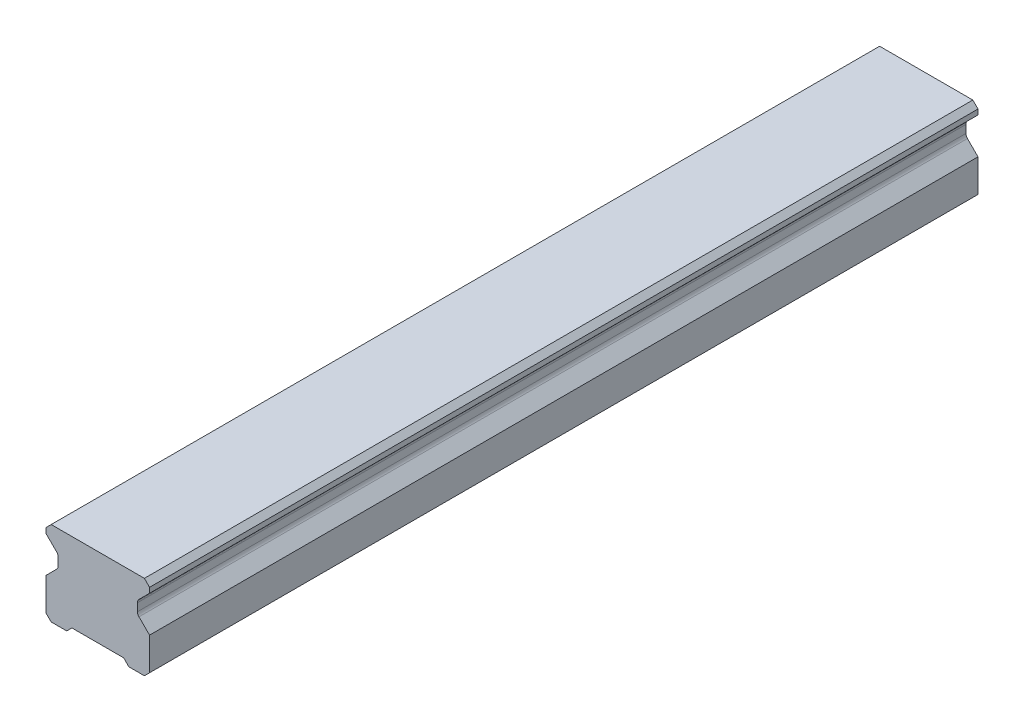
ISO-10303-21;
HEADER;
FILE_DESCRIPTION(('STEP AP214'),'2;1');
FILE_NAME('part.step','',(''),(''),'','','');
FILE_SCHEMA(('AUTOMOTIVE_DESIGN { 1 0 10303 214 1 1 1 1 }'));
ENDSEC;
DATA;
#1=APPLICATION_CONTEXT('core data for automotive mechanical design processes');
#2=APPLICATION_PROTOCOL_DEFINITION('international standard','automotive_design',2000,#1);
#3=PRODUCT_CONTEXT('',#1,'mechanical');
#4=PRODUCT('Part','Part','',(#3));
#5=PRODUCT_RELATED_PRODUCT_CATEGORY('part','',(#4));
#6=PRODUCT_DEFINITION_FORMATION('','',#4);
#7=PRODUCT_DEFINITION_CONTEXT('part definition',#1,'design');
#8=PRODUCT_DEFINITION('design','',#6,#7);
#9=PRODUCT_DEFINITION_SHAPE('','',#8);
#10=(LENGTH_UNIT() NAMED_UNIT(*) SI_UNIT(.MILLI.,.METRE.));
#11=(NAMED_UNIT(*) PLANE_ANGLE_UNIT() SI_UNIT($,.RADIAN.));
#12=(NAMED_UNIT(*) SI_UNIT($,.STERADIAN.) SOLID_ANGLE_UNIT());
#13=UNCERTAINTY_MEASURE_WITH_UNIT(LENGTH_MEASURE(1.E-05),#10,'distance_accuracy_value','');
#14=(GEOMETRIC_REPRESENTATION_CONTEXT(3) GLOBAL_UNCERTAINTY_ASSIGNED_CONTEXT((#13)) GLOBAL_UNIT_ASSIGNED_CONTEXT((#10,
#11,#12)) REPRESENTATION_CONTEXT('',''));
#15=CARTESIAN_POINT('',(0.,0.,0.));
#16=DIRECTION('',(0.,0.,1.));
#17=DIRECTION('',(1.,0.,0.));
#18=AXIS2_PLACEMENT_3D('',#15,#16,#17);
#19=CARTESIAN_POINT('',(0.,11.,-60.));
#20=DIRECTION('',(0.,-1.,0.));
#21=DIRECTION('',(0.,0.,-1.));
#22=AXIS2_PLACEMENT_3D('',#19,#20,#21);
#23=PLANE('',#22);
#24=CARTESIAN_POINT('',(0.,11.,-60.));
#25=DIRECTION('',(0.,-1.,0.));
#26=DIRECTION('',(0.,0.,-1.));
#27=AXIS2_PLACEMENT_3D('',#24,#25,#26);
#28=CIRCLE('',#27,2.5);
#29=CARTESIAN_POINT('',(0.,11.,-62.5));
#30=VERTEX_POINT('',#29);
#31=EDGE_CURVE('E42',#30,#30,#28,.T.);
#32=ORIENTED_EDGE('',*,*,#31,.F.);
#33=EDGE_LOOP('',(#32));
#34=FACE_BOUND('',#33,.T.);
#35=CARTESIAN_POINT('',(0.,11.,-60.));
#36=DIRECTION('',(0.,-1.,0.));
#37=DIRECTION('',(0.,0.,-1.));
#38=AXIS2_PLACEMENT_3D('',#35,#36,#37);
#39=CIRCLE('',#38,3.);
#40=CARTESIAN_POINT('',(0.,11.,-63.));
#41=VERTEX_POINT('',#40);
#42=EDGE_CURVE('E11',#41,#41,#39,.T.);
#43=ORIENTED_EDGE('',*,*,#42,.T.);
#44=EDGE_LOOP('',(#43));
#45=FACE_BOUND('',#44,.T.);
#46=ADVANCED_FACE('F39',(#34,#45),#23,.T.);
#47=CARTESIAN_POINT('',(0.,11.,-60.));
#48=DIRECTION('',(0.,-1.,0.));
#49=DIRECTION('',(0.,0.,-1.));
#50=AXIS2_PLACEMENT_3D('',#47,#48,#49);
#51=CYLINDRICAL_SURFACE('',#50,3.);
#52=ORIENTED_EDGE('',*,*,#42,.F.);
#53=EDGE_LOOP('',(#52));
#54=FACE_BOUND('',#53,.T.);
#55=CARTESIAN_POINT('',(0.,1.00000000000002,-60.));
#56=DIRECTION('',(0.,-1.,0.));
#57=DIRECTION('',(0.,0.,-1.));
#58=AXIS2_PLACEMENT_3D('',#55,#56,#57);
#59=CIRCLE('',#58,3.);
#60=CARTESIAN_POINT('',(0.,1.00000000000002,-63.));
#61=VERTEX_POINT('',#60);
#62=EDGE_CURVE('E48',#61,#61,#59,.T.);
#63=ORIENTED_EDGE('',*,*,#62,.T.);
#64=EDGE_LOOP('',(#63));
#65=FACE_BOUND('',#64,.T.);
#66=ADVANCED_FACE('F491',(#54,#65),#51,.F.);
#67=CARTESIAN_POINT('',(10.,0.,80.));
#68=DIRECTION('',(0.,1.,0.));
#69=DIRECTION('',(-1.,0.,0.));
#70=AXIS2_PLACEMENT_3D('',#67,#68,#69);
#71=PLANE('',#70);
#72=DIRECTION('',(1.,0.,0.));
#73=VECTOR('',#72,1.);
#74=CARTESIAN_POINT('',(10.,0.,-80.));
#75=LINE('',#74,#73);
#76=CARTESIAN_POINT('',(-9.,0.,-80.));
#77=VERTEX_POINT('',#76);
#78=CARTESIAN_POINT('',(-6.00000000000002,0.,-80.));
#79=VERTEX_POINT('',#78);
#80=EDGE_CURVE('E370',#77,#79,#75,.T.);
#81=ORIENTED_EDGE('',*,*,#80,.T.);
#82=DIRECTION('',(0.,0.,1.));
#83=VECTOR('',#82,1.);
#84=CARTESIAN_POINT('',(-6.00000000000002,0.,-80.));
#85=LINE('',#84,#83);
#86=CARTESIAN_POINT('',(-6.00000000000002,0.,80.));
#87=VERTEX_POINT('',#86);
#88=EDGE_CURVE('E276',#79,#87,#85,.T.);
#89=ORIENTED_EDGE('',*,*,#88,.T.);
#90=DIRECTION('',(1.,0.,0.));
#91=VECTOR('',#90,1.);
#92=CARTESIAN_POINT('',(10.,0.,80.));
#93=LINE('',#92,#91);
#94=CARTESIAN_POINT('',(-9.,0.,80.));
#95=VERTEX_POINT('',#94);
#96=EDGE_CURVE('E351',#95,#87,#93,.T.);
#97=ORIENTED_EDGE('',*,*,#96,.F.);
#98=DIRECTION('',(0.,0.,-1.));
#99=VECTOR('',#98,1.);
#100=CARTESIAN_POINT('',(-9.,0.,80.));
#101=LINE('',#100,#99);
#102=EDGE_CURVE('E422',#95,#77,#101,.T.);
#103=ORIENTED_EDGE('',*,*,#102,.T.);
#104=EDGE_LOOP('',(#81,#89,#97,#103));
#105=FACE_BOUND('',#104,.T.);
#106=ADVANCED_FACE('F516',(#105),#71,.F.);
#107=CARTESIAN_POINT('',(-10.,16.3,80.));
#108=DIRECTION('',(1.,0.,0.));
#109=DIRECTION('',(0.,1.,0.));
#110=AXIS2_PLACEMENT_3D('',#107,#108,#109);
#111=PLANE('',#110);
#112=DIRECTION('',(0.,-1.,0.));
#113=VECTOR('',#112,1.);
#114=CARTESIAN_POINT('',(-10.,16.3,80.));
#115=LINE('',#114,#113);
#116=CARTESIAN_POINT('',(-10.,15.3,80.));
#117=VERTEX_POINT('',#116);
#118=CARTESIAN_POINT('',(-10.,14.3,80.));
#119=VERTEX_POINT('',#118);
#120=EDGE_CURVE('E345',#117,#119,#115,.T.);
#121=ORIENTED_EDGE('',*,*,#120,.F.);
#122=DIRECTION('',(0.,0.,-1.));
#123=VECTOR('',#122,1.);
#124=CARTESIAN_POINT('',(-10.,15.3,80.));
#125=LINE('',#124,#123);
#126=CARTESIAN_POINT('',(-10.,15.3,-80.));
#127=VERTEX_POINT('',#126);
#128=EDGE_CURVE('E364',#117,#127,#125,.T.);
#129=ORIENTED_EDGE('',*,*,#128,.T.);
#130=DIRECTION('',(0.,-1.,0.));
#131=VECTOR('',#130,1.);
#132=CARTESIAN_POINT('',(-10.,16.3,-80.));
#133=LINE('',#132,#131);
#134=CARTESIAN_POINT('',(-10.,14.3,-80.));
#135=VERTEX_POINT('',#134);
#136=EDGE_CURVE('E365',#127,#135,#133,.T.);
#137=ORIENTED_EDGE('',*,*,#136,.T.);
#138=DIRECTION('',(0.,0.,1.));
#139=VECTOR('',#138,1.);
#140=CARTESIAN_POINT('',(-10.,14.3,-80.));
#141=LINE('',#140,#139);
#142=EDGE_CURVE('E299',#135,#119,#141,.T.);
#143=ORIENTED_EDGE('',*,*,#142,.T.);
#144=EDGE_LOOP('',(#121,#129,#137,#143));
#145=FACE_BOUND('',#144,.T.);
#146=ADVANCED_FACE('F555',(#145),#111,.F.);
#147=CARTESIAN_POINT('',(10.,16.3,80.));
#148=DIRECTION('',(-1.,0.,0.));
#149=DIRECTION('',(0.,-1.,0.));
#150=AXIS2_PLACEMENT_3D('',#147,#148,#149);
#151=PLANE('',#150);
#152=DIRECTION('',(0.,1.,0.));
#153=VECTOR('',#152,1.);
#154=CARTESIAN_POINT('',(10.,16.3,80.));
#155=LINE('',#154,#153);
#156=CARTESIAN_POINT('',(10.,1.00000000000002,80.));
#157=VERTEX_POINT('',#156);
#158=CARTESIAN_POINT('',(10.,7.3,80.));
#159=VERTEX_POINT('',#158);
#160=EDGE_CURVE('E356',#157,#159,#155,.T.);
#161=ORIENTED_EDGE('',*,*,#160,.F.);
#162=DIRECTION('',(0.,0.,-1.));
#163=VECTOR('',#162,1.);
#164=CARTESIAN_POINT('',(10.,1.00000000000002,80.));
#165=LINE('',#164,#163);
#166=CARTESIAN_POINT('',(10.,1.00000000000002,-80.));
#167=VERTEX_POINT('',#166);
#168=EDGE_CURVE('E429',#157,#167,#165,.T.);
#169=ORIENTED_EDGE('',*,*,#168,.T.);
#170=DIRECTION('',(0.,1.,0.));
#171=VECTOR('',#170,1.);
#172=CARTESIAN_POINT('',(10.,16.3,-80.));
#173=LINE('',#172,#171);
#174=CARTESIAN_POINT('',(10.,7.3,-80.));
#175=VERTEX_POINT('',#174);
#176=EDGE_CURVE('E375',#167,#175,#173,.T.);
#177=ORIENTED_EDGE('',*,*,#176,.T.);
#178=DIRECTION('',(0.,0.,1.));
#179=VECTOR('',#178,1.);
#180=CARTESIAN_POINT('',(10.,7.3,-80.));
#181=LINE('',#180,#179);
#182=EDGE_CURVE('E330',#175,#159,#181,.T.);
#183=ORIENTED_EDGE('',*,*,#182,.T.);
#184=EDGE_LOOP('',(#161,#169,#177,#183));
#185=FACE_BOUND('',#184,.T.);
#186=ADVANCED_FACE('F602',(#185),#151,.F.);
#187=CARTESIAN_POINT('',(-10.,7.3,-80.));
#188=VERTEX_POINT('',#187);
#189=CARTESIAN_POINT('',(-10.,1.00000000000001,-80.));
#190=VERTEX_POINT('',#189);
#191=EDGE_CURVE('E314',#188,#190,#133,.T.);
#192=ORIENTED_EDGE('',*,*,#191,.T.);
#193=DIRECTION('',(0.,0.,1.));
#194=VECTOR('',#193,1.);
#195=CARTESIAN_POINT('',(-10.,1.00000000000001,80.));
#196=LINE('',#195,#194);
#197=CARTESIAN_POINT('',(-10.,1.00000000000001,80.));
#198=VERTEX_POINT('',#197);
#199=EDGE_CURVE('E426',#190,#198,#196,.T.);
#200=ORIENTED_EDGE('',*,*,#199,.T.);
#201=CARTESIAN_POINT('',(-10.,7.3,80.));
#202=VERTEX_POINT('',#201);
#203=EDGE_CURVE('E350',#202,#198,#115,.T.);
#204=ORIENTED_EDGE('',*,*,#203,.F.);
#205=DIRECTION('',(0.,0.,1.));
#206=VECTOR('',#205,1.);
#207=CARTESIAN_POINT('',(-10.,7.3,-80.));
#208=LINE('',#207,#206);
#209=EDGE_CURVE('E311',#188,#202,#208,.T.);
#210=ORIENTED_EDGE('',*,*,#209,.F.);
#211=EDGE_LOOP('',(#192,#200,#204,#210));
#212=FACE_BOUND('',#211,.T.);
#213=ADVANCED_FACE('F598',(#212),#111,.F.);
#214=CARTESIAN_POINT('',(6.00000000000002,0.,80.));
#215=VERTEX_POINT('',#214);
#216=CARTESIAN_POINT('',(8.99999999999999,0.,80.));
#217=VERTEX_POINT('',#216);
#218=EDGE_CURVE('E349',#215,#217,#93,.T.);
#219=ORIENTED_EDGE('',*,*,#218,.F.);
#220=DIRECTION('',(0.,0.,1.));
#221=VECTOR('',#220,1.);
#222=CARTESIAN_POINT('',(6.00000000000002,0.,-80.));
#223=LINE('',#222,#221);
#224=CARTESIAN_POINT('',(6.00000000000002,0.,-80.));
#225=VERTEX_POINT('',#224);
#226=EDGE_CURVE('E266',#225,#215,#223,.T.);
#227=ORIENTED_EDGE('',*,*,#226,.F.);
#228=CARTESIAN_POINT('',(8.99999999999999,0.,-80.));
#229=VERTEX_POINT('',#228);
#230=EDGE_CURVE('E369',#225,#229,#75,.T.);
#231=ORIENTED_EDGE('',*,*,#230,.T.);
#232=DIRECTION('',(0.,0.,1.));
#233=VECTOR('',#232,1.);
#234=CARTESIAN_POINT('',(8.99999999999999,0.,80.));
#235=LINE('',#234,#233);
#236=EDGE_CURVE('E418',#229,#217,#235,.T.);
#237=ORIENTED_EDGE('',*,*,#236,.T.);
#238=EDGE_LOOP('',(#219,#227,#231,#237));
#239=FACE_BOUND('',#238,.T.);
#240=ADVANCED_FACE('F601',(#239),#71,.F.);
#241=CARTESIAN_POINT('',(10.,14.3,-80.));
#242=VERTEX_POINT('',#241);
#243=CARTESIAN_POINT('',(10.,15.3,-80.));
#244=VERTEX_POINT('',#243);
#245=EDGE_CURVE('E374',#242,#244,#173,.T.);
#246=ORIENTED_EDGE('',*,*,#245,.T.);
#247=DIRECTION('',(0.,0.,1.));
#248=VECTOR('',#247,1.);
#249=CARTESIAN_POINT('',(10.,15.3,80.));
#250=LINE('',#249,#248);
#251=CARTESIAN_POINT('',(10.,15.3,80.));
#252=VERTEX_POINT('',#251);
#253=EDGE_CURVE('E433',#244,#252,#250,.T.);
#254=ORIENTED_EDGE('',*,*,#253,.T.);
#255=CARTESIAN_POINT('',(10.,14.3,80.));
#256=VERTEX_POINT('',#255);
#257=EDGE_CURVE('E355',#256,#252,#155,.T.);
#258=ORIENTED_EDGE('',*,*,#257,.F.);
#259=DIRECTION('',(0.,0.,1.));
#260=VECTOR('',#259,1.);
#261=CARTESIAN_POINT('',(10.,14.3,-80.));
#262=LINE('',#261,#260);
#263=EDGE_CURVE('E304',#242,#256,#262,.T.);
#264=ORIENTED_EDGE('',*,*,#263,.F.);
#265=EDGE_LOOP('',(#246,#254,#258,#264));
#266=FACE_BOUND('',#265,.T.);
#267=ADVANCED_FACE('F533',(#266),#151,.F.);
#268=CARTESIAN_POINT('',(10.,16.3,80.));
#269=DIRECTION('',(0.,-1.,0.));
#270=DIRECTION('',(0.,0.,-1.));
#271=AXIS2_PLACEMENT_3D('',#268,#269,#270);
#272=PLANE('',#271);
#273=DIRECTION('',(-1.,0.,0.));
#274=VECTOR('',#273,1.);
#275=CARTESIAN_POINT('',(10.,16.3,-80.));
#276=LINE('',#275,#274);
#277=CARTESIAN_POINT('',(9.00000000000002,16.3,-80.));
#278=VERTEX_POINT('',#277);
#279=CARTESIAN_POINT('',(-9.,16.3,-80.));
#280=VERTEX_POINT('',#279);
#281=EDGE_CURVE('E379',#278,#280,#276,.T.);
#282=ORIENTED_EDGE('',*,*,#281,.T.);
#283=DIRECTION('',(0.,0.,1.));
#284=VECTOR('',#283,1.);
#285=CARTESIAN_POINT('',(-9.,16.3,80.));
#286=LINE('',#285,#284);
#287=CARTESIAN_POINT('',(-9.,16.3,80.));
#288=VERTEX_POINT('',#287);
#289=EDGE_CURVE('E403',#280,#288,#286,.T.);
#290=ORIENTED_EDGE('',*,*,#289,.T.);
#291=DIRECTION('',(-1.,0.,0.));
#292=VECTOR('',#291,1.);
#293=CARTESIAN_POINT('',(10.,16.3,80.));
#294=LINE('',#293,#292);
#295=CARTESIAN_POINT('',(9.00000000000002,16.3,80.));
#296=VERTEX_POINT('',#295);
#297=EDGE_CURVE('E360',#296,#288,#294,.T.);
#298=ORIENTED_EDGE('',*,*,#297,.F.);
#299=DIRECTION('',(0.,0.,-1.));
#300=VECTOR('',#299,1.);
#301=CARTESIAN_POINT('',(9.00000000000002,16.3,80.));
#302=LINE('',#301,#300);
#303=EDGE_CURVE('E399',#296,#278,#302,.T.);
#304=ORIENTED_EDGE('',*,*,#303,.T.);
#305=EDGE_LOOP('',(#282,#290,#298,#304));
#306=FACE_BOUND('',#305,.T.);
#307=ADVANCED_FACE('F546',(#306),#272,.F.);
#308=CARTESIAN_POINT('',(0.,0.,80.));
#309=DIRECTION('',(0.,0.,-1.));
#310=DIRECTION('',(-1.,0.,0.));
#311=AXIS2_PLACEMENT_3D('',#308,#309,#310);
#312=PLANE('',#311);
#313=ORIENTED_EDGE('',*,*,#96,.T.);
#314=DIRECTION('',(-0.707106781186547,-0.707106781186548,0.));
#315=VECTOR('',#314,1.);
#316=CARTESIAN_POINT('',(-6.00000000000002,0.,80.));
#317=LINE('',#316,#315);
#318=CARTESIAN_POINT('',(-5.,1.00000000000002,80.));
#319=VERTEX_POINT('',#318);
#320=EDGE_CURVE('E259',#319,#87,#317,.T.);
#321=ORIENTED_EDGE('',*,*,#320,.F.);
#322=DIRECTION('',(-1.,0.,0.));
#323=VECTOR('',#322,1.);
#324=CARTESIAN_POINT('',(-5.,1.00000000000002,80.));
#325=LINE('',#324,#323);
#326=CARTESIAN_POINT('',(5.,1.00000000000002,80.));
#327=VERTEX_POINT('',#326);
#328=EDGE_CURVE('E270',#327,#319,#325,.T.);
#329=ORIENTED_EDGE('',*,*,#328,.F.);
#330=DIRECTION('',(-0.707106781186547,0.707106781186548,0.));
#331=VECTOR('',#330,1.);
#332=CARTESIAN_POINT('',(5.,1.00000000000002,80.));
#333=LINE('',#332,#331);
#334=EDGE_CURVE('E251',#215,#327,#333,.T.);
#335=ORIENTED_EDGE('',*,*,#334,.F.);
#336=ORIENTED_EDGE('',*,*,#218,.T.);
#337=DIRECTION('',(-0.707106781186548,-0.707106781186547,0.));
#338=VECTOR('',#337,1.);
#339=CARTESIAN_POINT('',(10.,1.00000000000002,80.));
#340=LINE('',#339,#338);
#341=EDGE_CURVE('E409',#217,#157,#340,.F.);
#342=ORIENTED_EDGE('',*,*,#341,.T.);
#343=ORIENTED_EDGE('',*,*,#160,.T.);
#344=DIRECTION('',(0.707106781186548,-0.707106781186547,0.));
#345=VECTOR('',#344,1.);
#346=CARTESIAN_POINT('',(10.,7.3,80.));
#347=LINE('',#346,#345);
#348=CARTESIAN_POINT('',(7.95955988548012,9.34044011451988,80.));
#349=VERTEX_POINT('',#348);
#350=EDGE_CURVE('E280',#349,#159,#347,.T.);
#351=ORIENTED_EDGE('',*,*,#350,.F.);
#352=CARTESIAN_POINT('',(8.66666666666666,10.0475468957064,80.));
#353=DIRECTION('',(0.,0.,-1.));
#354=DIRECTION('',(-1.,0.,0.));
#355=AXIS2_PLACEMENT_3D('',#352,#353,#354);
#356=CIRCLE('',#355,1.);
#357=CARTESIAN_POINT('',(7.66666666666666,10.0475468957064,80.));
#358=VERTEX_POINT('',#357);
#359=EDGE_CURVE('E464',#349,#358,#356,.T.);
#360=ORIENTED_EDGE('',*,*,#359,.T.);
#361=DIRECTION('',(0.,-1.,0.));
#362=VECTOR('',#361,1.);
#363=CARTESIAN_POINT('',(7.66666666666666,9.63333333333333,80.));
#364=LINE('',#363,#362);
#365=CARTESIAN_POINT('',(7.66666666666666,11.5524531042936,80.));
#366=VERTEX_POINT('',#365);
#367=EDGE_CURVE('E322',#366,#358,#364,.T.);
#368=ORIENTED_EDGE('',*,*,#367,.F.);
#369=CARTESIAN_POINT('',(8.66666666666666,11.5524531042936,80.));
#370=DIRECTION('',(0.,0.,-1.));
#371=DIRECTION('',(-1.,0.,0.));
#372=AXIS2_PLACEMENT_3D('',#369,#370,#371);
#373=CIRCLE('',#372,1.);
#374=CARTESIAN_POINT('',(7.95955988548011,12.2595598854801,80.));
#375=VERTEX_POINT('',#374);
#376=EDGE_CURVE('E470',#366,#375,#373,.T.);
#377=ORIENTED_EDGE('',*,*,#376,.T.);
#378=DIRECTION('',(-0.707106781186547,-0.707106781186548,0.));
#379=VECTOR('',#378,1.);
#380=CARTESIAN_POINT('',(7.66666666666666,11.9666666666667,80.));
#381=LINE('',#380,#379);
#382=EDGE_CURVE('E333',#256,#375,#381,.T.);
#383=ORIENTED_EDGE('',*,*,#382,.F.);
#384=ORIENTED_EDGE('',*,*,#257,.T.);
#385=DIRECTION('',(0.707106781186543,-0.707106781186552,0.));
#386=VECTOR('',#385,1.);
#387=CARTESIAN_POINT('',(9.00000000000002,16.3,80.));
#388=LINE('',#387,#386);
#389=EDGE_CURVE('E406',#252,#296,#388,.F.);
#390=ORIENTED_EDGE('',*,*,#389,.T.);
#391=ORIENTED_EDGE('',*,*,#297,.T.);
#392=DIRECTION('',(0.707106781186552,0.707106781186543,0.));
#393=VECTOR('',#392,1.);
#394=CARTESIAN_POINT('',(-10.,15.3,80.));
#395=LINE('',#394,#393);
#396=EDGE_CURVE('E415',#288,#117,#395,.F.);
#397=ORIENTED_EDGE('',*,*,#396,.T.);
#398=ORIENTED_EDGE('',*,*,#120,.T.);
#399=DIRECTION('',(-0.707106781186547,0.707106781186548,0.));
#400=VECTOR('',#399,1.);
#401=CARTESIAN_POINT('',(-7.66666666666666,11.9666666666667,80.));
#402=LINE('',#401,#400);
#403=CARTESIAN_POINT('',(-7.95955988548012,12.2595598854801,80.));
#404=VERTEX_POINT('',#403);
#405=EDGE_CURVE('E300',#404,#119,#402,.T.);
#406=ORIENTED_EDGE('',*,*,#405,.F.);
#407=CARTESIAN_POINT('',(-8.66666666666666,11.5524531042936,80.));
#408=DIRECTION('',(0.,0.,-1.));
#409=DIRECTION('',(-1.,0.,0.));
#410=AXIS2_PLACEMENT_3D('',#407,#408,#409);
#411=CIRCLE('',#410,1.);
#412=CARTESIAN_POINT('',(-7.66666666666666,11.5524531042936,80.));
#413=VERTEX_POINT('',#412);
#414=EDGE_CURVE('E482',#404,#413,#411,.T.);
#415=ORIENTED_EDGE('',*,*,#414,.T.);
#416=DIRECTION('',(0.,1.,0.));
#417=VECTOR('',#416,1.);
#418=CARTESIAN_POINT('',(-7.66666666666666,9.63333333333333,80.));
#419=LINE('',#418,#417);
#420=CARTESIAN_POINT('',(-7.66666666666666,10.0475468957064,80.));
#421=VERTEX_POINT('',#420);
#422=EDGE_CURVE('E292',#421,#413,#419,.T.);
#423=ORIENTED_EDGE('',*,*,#422,.F.);
#424=CARTESIAN_POINT('',(-8.66666666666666,10.0475468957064,80.));
#425=DIRECTION('',(0.,0.,-1.));
#426=DIRECTION('',(-1.,0.,0.));
#427=AXIS2_PLACEMENT_3D('',#424,#425,#426);
#428=CIRCLE('',#427,1.);
#429=CARTESIAN_POINT('',(-7.95955988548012,9.34044011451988,80.));
#430=VERTEX_POINT('',#429);
#431=EDGE_CURVE('E476',#421,#430,#428,.T.);
#432=ORIENTED_EDGE('',*,*,#431,.T.);
#433=DIRECTION('',(0.707106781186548,0.707106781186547,0.));
#434=VECTOR('',#433,1.);
#435=CARTESIAN_POINT('',(-10.,7.3,80.));
#436=LINE('',#435,#434);
#437=EDGE_CURVE('E303',#202,#430,#436,.T.);
#438=ORIENTED_EDGE('',*,*,#437,.F.);
#439=ORIENTED_EDGE('',*,*,#203,.T.);
#440=DIRECTION('',(-0.707106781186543,0.707106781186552,0.));
#441=VECTOR('',#440,1.);
#442=CARTESIAN_POINT('',(-9.,0.,80.));
#443=LINE('',#442,#441);
#444=EDGE_CURVE('E412',#198,#95,#443,.F.);
#445=ORIENTED_EDGE('',*,*,#444,.T.);
#446=EDGE_LOOP('',(#313,#321,#329,#335,#336,#342,#343,#351,#360,#368,#377,#383,#384,#390,#391,
#397,#398,#406,#415,#423,#432,#438,#439,#445));
#447=FACE_BOUND('',#446,.T.);
#448=ADVANCED_FACE('F542',(#447),#312,.F.);
#449=CARTESIAN_POINT('',(0.,0.,-80.));
#450=DIRECTION('',(0.,0.,-1.));
#451=DIRECTION('',(-1.,0.,0.));
#452=AXIS2_PLACEMENT_3D('',#449,#450,#451);
#453=PLANE('',#452);
#454=DIRECTION('',(-0.707106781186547,-0.707106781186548,0.));
#455=VECTOR('',#454,1.);
#456=CARTESIAN_POINT('',(-6.00000000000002,0.,-80.));
#457=LINE('',#456,#455);
#458=CARTESIAN_POINT('',(-5.,1.00000000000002,-80.));
#459=VERTEX_POINT('',#458);
#460=EDGE_CURVE('E262',#459,#79,#457,.T.);
#461=ORIENTED_EDGE('',*,*,#460,.T.);
#462=ORIENTED_EDGE('',*,*,#80,.F.);
#463=DIRECTION('',(0.707106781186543,-0.707106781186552,0.));
#464=VECTOR('',#463,1.);
#465=CARTESIAN_POINT('',(-4.50000000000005,-4.5,-80.));
#466=LINE('',#465,#464);
#467=EDGE_CURVE('E393',#77,#190,#466,.F.);
#468=ORIENTED_EDGE('',*,*,#467,.T.);
#469=ORIENTED_EDGE('',*,*,#191,.F.);
#470=DIRECTION('',(0.707106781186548,0.707106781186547,0.));
#471=VECTOR('',#470,1.);
#472=CARTESIAN_POINT('',(-10.,7.3,-80.));
#473=LINE('',#472,#471);
#474=CARTESIAN_POINT('',(-7.95955988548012,9.34044011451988,-80.));
#475=VERTEX_POINT('',#474);
#476=EDGE_CURVE('E291',#188,#475,#473,.T.);
#477=ORIENTED_EDGE('',*,*,#476,.T.);
#478=CARTESIAN_POINT('',(-8.66666666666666,10.0475468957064,-80.));
#479=DIRECTION('',(0.,0.,-1.));
#480=DIRECTION('',(-1.,0.,0.));
#481=AXIS2_PLACEMENT_3D('',#478,#479,#480);
#482=CIRCLE('',#481,1.);
#483=CARTESIAN_POINT('',(-7.66666666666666,10.0475468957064,-80.));
#484=VERTEX_POINT('',#483);
#485=EDGE_CURVE('E479',#475,#484,#482,.F.);
#486=ORIENTED_EDGE('',*,*,#485,.T.);
#487=DIRECTION('',(0.,1.,0.));
#488=VECTOR('',#487,1.);
#489=CARTESIAN_POINT('',(-7.66666666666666,9.63333333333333,-80.));
#490=LINE('',#489,#488);
#491=CARTESIAN_POINT('',(-7.66666666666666,11.5524531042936,-80.));
#492=VERTEX_POINT('',#491);
#493=EDGE_CURVE('E296',#484,#492,#490,.T.);
#494=ORIENTED_EDGE('',*,*,#493,.T.);
#495=CARTESIAN_POINT('',(-8.66666666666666,11.5524531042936,-80.));
#496=DIRECTION('',(0.,0.,-1.));
#497=DIRECTION('',(-1.,0.,0.));
#498=AXIS2_PLACEMENT_3D('',#495,#496,#497);
#499=CIRCLE('',#498,1.);
#500=CARTESIAN_POINT('',(-7.95955988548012,12.2595598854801,-80.));
#501=VERTEX_POINT('',#500);
#502=EDGE_CURVE('E64',#492,#501,#499,.F.);
#503=ORIENTED_EDGE('',*,*,#502,.T.);
#504=DIRECTION('',(-0.707106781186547,0.707106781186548,0.));
#505=VECTOR('',#504,1.);
#506=CARTESIAN_POINT('',(-7.66666666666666,11.9666666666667,-80.));
#507=LINE('',#506,#505);
#508=EDGE_CURVE('E288',#501,#135,#507,.T.);
#509=ORIENTED_EDGE('',*,*,#508,.T.);
#510=ORIENTED_EDGE('',*,*,#136,.F.);
#511=DIRECTION('',(-0.707106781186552,-0.707106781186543,0.));
#512=VECTOR('',#511,1.);
#513=CARTESIAN_POINT('',(-12.6499999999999,12.6500000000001,-80.));
#514=LINE('',#513,#512);
#515=EDGE_CURVE('E396',#127,#280,#514,.F.);
#516=ORIENTED_EDGE('',*,*,#515,.T.);
#517=ORIENTED_EDGE('',*,*,#281,.F.);
#518=DIRECTION('',(-0.707106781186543,0.707106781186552,0.));
#519=VECTOR('',#518,1.);
#520=CARTESIAN_POINT('',(12.6500000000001,12.6499999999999,-80.));
#521=LINE('',#520,#519);
#522=EDGE_CURVE('E386',#278,#244,#521,.F.);
#523=ORIENTED_EDGE('',*,*,#522,.T.);
#524=ORIENTED_EDGE('',*,*,#245,.F.);
#525=DIRECTION('',(-0.707106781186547,-0.707106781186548,0.));
#526=VECTOR('',#525,1.);
#527=CARTESIAN_POINT('',(7.66666666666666,11.9666666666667,-80.));
#528=LINE('',#527,#526);
#529=CARTESIAN_POINT('',(7.95955988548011,12.2595598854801,-80.));
#530=VERTEX_POINT('',#529);
#531=EDGE_CURVE('E321',#242,#530,#528,.T.);
#532=ORIENTED_EDGE('',*,*,#531,.T.);
#533=CARTESIAN_POINT('',(8.66666666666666,11.5524531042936,-80.));
#534=DIRECTION('',(0.,0.,-1.));
#535=DIRECTION('',(-1.,0.,0.));
#536=AXIS2_PLACEMENT_3D('',#533,#534,#535);
#537=CIRCLE('',#536,1.);
#538=CARTESIAN_POINT('',(7.66666666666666,11.5524531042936,-80.));
#539=VERTEX_POINT('',#538);
#540=EDGE_CURVE('E473',#530,#539,#537,.F.);
#541=ORIENTED_EDGE('',*,*,#540,.T.);
#542=DIRECTION('',(0.,-1.,0.));
#543=VECTOR('',#542,1.);
#544=CARTESIAN_POINT('',(7.66666666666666,9.63333333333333,-80.));
#545=LINE('',#544,#543);
#546=CARTESIAN_POINT('',(7.66666666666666,10.0475468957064,-80.));
#547=VERTEX_POINT('',#546);
#548=EDGE_CURVE('E326',#539,#547,#545,.T.);
#549=ORIENTED_EDGE('',*,*,#548,.T.);
#550=CARTESIAN_POINT('',(8.66666666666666,10.0475468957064,-80.));
#551=DIRECTION('',(0.,0.,-1.));
#552=DIRECTION('',(-1.,0.,0.));
#553=AXIS2_PLACEMENT_3D('',#550,#551,#552);
#554=CIRCLE('',#553,1.);
#555=CARTESIAN_POINT('',(7.95955988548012,9.34044011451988,-80.));
#556=VERTEX_POINT('',#555);
#557=EDGE_CURVE('E467',#547,#556,#554,.F.);
#558=ORIENTED_EDGE('',*,*,#557,.T.);
#559=DIRECTION('',(0.707106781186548,-0.707106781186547,0.));
#560=VECTOR('',#559,1.);
#561=CARTESIAN_POINT('',(10.,7.3,-80.));
#562=LINE('',#561,#560);
#563=EDGE_CURVE('E318',#556,#175,#562,.T.);
#564=ORIENTED_EDGE('',*,*,#563,.T.);
#565=ORIENTED_EDGE('',*,*,#176,.F.);
#566=DIRECTION('',(0.707106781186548,0.707106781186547,0.));
#567=VECTOR('',#566,1.);
#568=CARTESIAN_POINT('',(4.49999999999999,-4.49999999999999,-80.));
#569=LINE('',#568,#567);
#570=EDGE_CURVE('E389',#167,#229,#569,.F.);
#571=ORIENTED_EDGE('',*,*,#570,.T.);
#572=ORIENTED_EDGE('',*,*,#230,.F.);
#573=DIRECTION('',(-0.707106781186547,0.707106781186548,0.));
#574=VECTOR('',#573,1.);
#575=CARTESIAN_POINT('',(5.,1.00000000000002,-80.));
#576=LINE('',#575,#574);
#577=CARTESIAN_POINT('',(5.,1.00000000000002,-80.));
#578=VERTEX_POINT('',#577);
#579=EDGE_CURVE('E255',#225,#578,#576,.T.);
#580=ORIENTED_EDGE('',*,*,#579,.T.);
#581=DIRECTION('',(-1.,0.,0.));
#582=VECTOR('',#581,1.);
#583=CARTESIAN_POINT('',(-5.,1.00000000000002,-80.));
#584=LINE('',#583,#582);
#585=EDGE_CURVE('E56',#578,#459,#584,.T.);
#586=ORIENTED_EDGE('',*,*,#585,.T.);
#587=EDGE_LOOP('',(#461,#462,#468,#469,#477,#486,#494,#503,#509,#510,#516,#517,#523,#524,#532,
#541,#549,#558,#564,#565,#571,#572,#580,#586));
#588=FACE_BOUND('',#587,.T.);
#589=ADVANCED_FACE('F611',(#588),#453,.T.);
#590=CARTESIAN_POINT('',(10.,7.3,-80.));
#591=DIRECTION('',(-0.707106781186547,-0.707106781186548,0.));
#592=DIRECTION('',(0.707106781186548,-0.707106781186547,0.));
#593=AXIS2_PLACEMENT_3D('',#590,#591,#592);
#594=PLANE('',#593);
#595=ORIENTED_EDGE('',*,*,#563,.F.);
#596=DIRECTION('',(0.,0.,1.));
#597=VECTOR('',#596,1.);
#598=CARTESIAN_POINT('',(7.95955988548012,9.34044011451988,80.));
#599=LINE('',#598,#597);
#600=EDGE_CURVE('E436',#556,#349,#599,.T.);
#601=ORIENTED_EDGE('',*,*,#600,.T.);
#602=ORIENTED_EDGE('',*,*,#350,.T.);
#603=ORIENTED_EDGE('',*,*,#182,.F.);
#604=EDGE_LOOP('',(#595,#601,#602,#603));
#605=FACE_BOUND('',#604,.T.);
#606=ADVANCED_FACE('F614',(#605),#594,.F.);
#607=CARTESIAN_POINT('',(7.66666666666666,9.63333333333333,-80.));
#608=DIRECTION('',(-1.,0.,0.));
#609=DIRECTION('',(0.,-1.,0.));
#610=AXIS2_PLACEMENT_3D('',#607,#608,#609);
#611=PLANE('',#610);
#612=ORIENTED_EDGE('',*,*,#367,.T.);
#613=DIRECTION('',(0.,0.,1.));
#614=VECTOR('',#613,1.);
#615=CARTESIAN_POINT('',(7.66666666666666,10.0475468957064,-80.));
#616=LINE('',#615,#614);
#617=EDGE_CURVE('E444',#358,#547,#616,.F.);
#618=ORIENTED_EDGE('',*,*,#617,.T.);
#619=ORIENTED_EDGE('',*,*,#548,.F.);
#620=DIRECTION('',(0.,0.,1.));
#621=VECTOR('',#620,1.);
#622=CARTESIAN_POINT('',(7.66666666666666,11.5524531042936,80.));
#623=LINE('',#622,#621);
#624=EDGE_CURVE('E440',#539,#366,#623,.T.);
#625=ORIENTED_EDGE('',*,*,#624,.T.);
#626=EDGE_LOOP('',(#612,#618,#619,#625));
#627=FACE_BOUND('',#626,.T.);
#628=ADVANCED_FACE('F619',(#627),#611,.F.);
#629=CARTESIAN_POINT('',(7.66666666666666,11.9666666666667,-80.));
#630=DIRECTION('',(-0.707106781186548,0.707106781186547,0.));
#631=DIRECTION('',(-0.707106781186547,-0.707106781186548,0.));
#632=AXIS2_PLACEMENT_3D('',#629,#630,#631);
#633=PLANE('',#632);
#634=ORIENTED_EDGE('',*,*,#382,.T.);
#635=DIRECTION('',(0.,0.,1.));
#636=VECTOR('',#635,1.);
#637=CARTESIAN_POINT('',(7.95955988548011,12.2595598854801,-80.));
#638=LINE('',#637,#636);
#639=EDGE_CURVE('E447',#375,#530,#638,.F.);
#640=ORIENTED_EDGE('',*,*,#639,.T.);
#641=ORIENTED_EDGE('',*,*,#531,.F.);
#642=ORIENTED_EDGE('',*,*,#263,.T.);
#643=EDGE_LOOP('',(#634,#640,#641,#642));
#644=FACE_BOUND('',#643,.T.);
#645=ADVANCED_FACE('F621',(#644),#633,.F.);
#646=CARTESIAN_POINT('',(-7.66666666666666,11.9666666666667,-80.));
#647=DIRECTION('',(0.707106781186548,0.707106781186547,0.));
#648=DIRECTION('',(-0.707106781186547,0.707106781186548,0.));
#649=AXIS2_PLACEMENT_3D('',#646,#647,#648);
#650=PLANE('',#649);
#651=ORIENTED_EDGE('',*,*,#508,.F.);
#652=DIRECTION('',(0.,0.,1.));
#653=VECTOR('',#652,1.);
#654=CARTESIAN_POINT('',(-7.95955988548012,12.2595598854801,80.));
#655=LINE('',#654,#653);
#656=EDGE_CURVE('E460',#501,#404,#655,.T.);
#657=ORIENTED_EDGE('',*,*,#656,.T.);
#658=ORIENTED_EDGE('',*,*,#405,.T.);
#659=ORIENTED_EDGE('',*,*,#142,.F.);
#660=EDGE_LOOP('',(#651,#657,#658,#659));
#661=FACE_BOUND('',#660,.T.);
#662=ADVANCED_FACE('F559',(#661),#650,.F.);
#663=CARTESIAN_POINT('',(-7.66666666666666,9.63333333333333,-80.));
#664=DIRECTION('',(1.,0.,0.));
#665=DIRECTION('',(0.,1.,0.));
#666=AXIS2_PLACEMENT_3D('',#663,#664,#665);
#667=PLANE('',#666);
#668=ORIENTED_EDGE('',*,*,#493,.F.);
#669=DIRECTION('',(0.,0.,1.));
#670=VECTOR('',#669,1.);
#671=CARTESIAN_POINT('',(-7.66666666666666,10.0475468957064,80.));
#672=LINE('',#671,#670);
#673=EDGE_CURVE('E453',#484,#421,#672,.T.);
#674=ORIENTED_EDGE('',*,*,#673,.T.);
#675=ORIENTED_EDGE('',*,*,#422,.T.);
#676=DIRECTION('',(0.,0.,1.));
#677=VECTOR('',#676,1.);
#678=CARTESIAN_POINT('',(-7.66666666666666,11.5524531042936,-80.));
#679=LINE('',#678,#677);
#680=EDGE_CURVE('E450',#413,#492,#679,.F.);
#681=ORIENTED_EDGE('',*,*,#680,.T.);
#682=EDGE_LOOP('',(#668,#674,#675,#681));
#683=FACE_BOUND('',#682,.T.);
#684=ADVANCED_FACE('F566',(#683),#667,.F.);
#685=CARTESIAN_POINT('',(-10.,7.3,-80.));
#686=DIRECTION('',(0.707106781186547,-0.707106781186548,0.));
#687=DIRECTION('',(0.707106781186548,0.707106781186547,0.));
#688=AXIS2_PLACEMENT_3D('',#685,#686,#687);
#689=PLANE('',#688);
#690=ORIENTED_EDGE('',*,*,#437,.T.);
#691=DIRECTION('',(0.,0.,1.));
#692=VECTOR('',#691,1.);
#693=CARTESIAN_POINT('',(-7.95955988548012,9.34044011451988,-80.));
#694=LINE('',#693,#692);
#695=EDGE_CURVE('E457',#430,#475,#694,.F.);
#696=ORIENTED_EDGE('',*,*,#695,.T.);
#697=ORIENTED_EDGE('',*,*,#476,.F.);
#698=ORIENTED_EDGE('',*,*,#209,.T.);
#699=EDGE_LOOP('',(#690,#696,#697,#698));
#700=FACE_BOUND('',#699,.T.);
#701=ADVANCED_FACE('F597',(#700),#689,.F.);
#702=CARTESIAN_POINT('',(-10.,15.3,80.));
#703=DIRECTION('',(0.707106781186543,-0.707106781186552,0.));
#704=DIRECTION('',(0.,0.,-1.));
#705=AXIS2_PLACEMENT_3D('',#702,#703,#704);
#706=PLANE('',#705);
#707=ORIENTED_EDGE('',*,*,#396,.F.);
#708=ORIENTED_EDGE('',*,*,#289,.F.);
#709=ORIENTED_EDGE('',*,*,#515,.F.);
#710=ORIENTED_EDGE('',*,*,#128,.F.);
#711=EDGE_LOOP('',(#707,#708,#709,#710));
#712=FACE_BOUND('',#711,.T.);
#713=ADVANCED_FACE('F550',(#712),#706,.F.);
#714=CARTESIAN_POINT('',(-9.,0.,80.));
#715=DIRECTION('',(0.707106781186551,0.707106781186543,0.));
#716=DIRECTION('',(0.,0.,-1.));
#717=AXIS2_PLACEMENT_3D('',#714,#715,#716);
#718=PLANE('',#717);
#719=ORIENTED_EDGE('',*,*,#444,.F.);
#720=ORIENTED_EDGE('',*,*,#199,.F.);
#721=ORIENTED_EDGE('',*,*,#467,.F.);
#722=ORIENTED_EDGE('',*,*,#102,.F.);
#723=EDGE_LOOP('',(#719,#720,#721,#722));
#724=FACE_BOUND('',#723,.T.);
#725=ADVANCED_FACE('F590',(#724),#718,.F.);
#726=CARTESIAN_POINT('',(10.,1.00000000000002,80.));
#727=DIRECTION('',(-0.707106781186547,0.707106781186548,0.));
#728=DIRECTION('',(0.,0.,-1.));
#729=AXIS2_PLACEMENT_3D('',#726,#727,#728);
#730=PLANE('',#729);
#731=ORIENTED_EDGE('',*,*,#341,.F.);
#732=ORIENTED_EDGE('',*,*,#236,.F.);
#733=ORIENTED_EDGE('',*,*,#570,.F.);
#734=ORIENTED_EDGE('',*,*,#168,.F.);
#735=EDGE_LOOP('',(#731,#732,#733,#734));
#736=FACE_BOUND('',#735,.T.);
#737=ADVANCED_FACE('F587',(#736),#730,.F.);
#738=CARTESIAN_POINT('',(9.00000000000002,16.3,80.));
#739=DIRECTION('',(-0.707106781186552,-0.707106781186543,0.));
#740=DIRECTION('',(0.,0.,-1.));
#741=AXIS2_PLACEMENT_3D('',#738,#739,#740);
#742=PLANE('',#741);
#743=ORIENTED_EDGE('',*,*,#389,.F.);
#744=ORIENTED_EDGE('',*,*,#253,.F.);
#745=ORIENTED_EDGE('',*,*,#522,.F.);
#746=ORIENTED_EDGE('',*,*,#303,.F.);
#747=EDGE_LOOP('',(#743,#744,#745,#746));
#748=FACE_BOUND('',#747,.T.);
#749=ADVANCED_FACE('F538',(#748),#742,.F.);
#750=CARTESIAN_POINT('',(8.66666666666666,10.0475468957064,-80.));
#751=DIRECTION('',(0.,0.,-1.));
#752=DIRECTION('',(-1.,0.,0.));
#753=AXIS2_PLACEMENT_3D('',#750,#751,#752);
#754=CYLINDRICAL_SURFACE('',#753,1.);
#755=ORIENTED_EDGE('',*,*,#557,.F.);
#756=ORIENTED_EDGE('',*,*,#617,.F.);
#757=ORIENTED_EDGE('',*,*,#359,.F.);
#758=ORIENTED_EDGE('',*,*,#600,.F.);
#759=EDGE_LOOP('',(#755,#756,#757,#758));
#760=FACE_BOUND('',#759,.T.);
#761=ADVANCED_FACE('F580',(#760),#754,.F.);
#762=CARTESIAN_POINT('',(8.66666666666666,11.5524531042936,-80.));
#763=DIRECTION('',(0.,0.,-1.));
#764=DIRECTION('',(-1.,0.,0.));
#765=AXIS2_PLACEMENT_3D('',#762,#763,#764);
#766=CYLINDRICAL_SURFACE('',#765,1.);
#767=ORIENTED_EDGE('',*,*,#540,.F.);
#768=ORIENTED_EDGE('',*,*,#639,.F.);
#769=ORIENTED_EDGE('',*,*,#376,.F.);
#770=ORIENTED_EDGE('',*,*,#624,.F.);
#771=EDGE_LOOP('',(#767,#768,#769,#770));
#772=FACE_BOUND('',#771,.T.);
#773=ADVANCED_FACE('F574',(#772),#766,.F.);
#774=CARTESIAN_POINT('',(-8.66666666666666,10.0475468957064,-80.));
#775=DIRECTION('',(0.,0.,-1.));
#776=DIRECTION('',(-1.,0.,0.));
#777=AXIS2_PLACEMENT_3D('',#774,#775,#776);
#778=CYLINDRICAL_SURFACE('',#777,1.);
#779=ORIENTED_EDGE('',*,*,#485,.F.);
#780=ORIENTED_EDGE('',*,*,#695,.F.);
#781=ORIENTED_EDGE('',*,*,#431,.F.);
#782=ORIENTED_EDGE('',*,*,#673,.F.);
#783=EDGE_LOOP('',(#779,#780,#781,#782));
#784=FACE_BOUND('',#783,.T.);
#785=ADVANCED_FACE('F569',(#784),#778,.F.);
#786=CARTESIAN_POINT('',(-8.66666666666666,11.5524531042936,-80.));
#787=DIRECTION('',(0.,0.,-1.));
#788=DIRECTION('',(-1.,0.,0.));
#789=AXIS2_PLACEMENT_3D('',#786,#787,#788);
#790=CYLINDRICAL_SURFACE('',#789,1.);
#791=ORIENTED_EDGE('',*,*,#502,.F.);
#792=ORIENTED_EDGE('',*,*,#680,.F.);
#793=ORIENTED_EDGE('',*,*,#414,.F.);
#794=ORIENTED_EDGE('',*,*,#656,.F.);
#795=EDGE_LOOP('',(#791,#792,#793,#794));
#796=FACE_BOUND('',#795,.T.);
#797=ADVANCED_FACE('F506',(#796),#790,.F.);
#798=CARTESIAN_POINT('',(-6.00000000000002,0.,-80.));
#799=DIRECTION('',(-0.707106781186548,0.707106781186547,0.));
#800=DIRECTION('',(-0.707106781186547,-0.707106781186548,0.));
#801=AXIS2_PLACEMENT_3D('',#798,#799,#800);
#802=PLANE('',#801);
#803=ORIENTED_EDGE('',*,*,#320,.T.);
#804=ORIENTED_EDGE('',*,*,#88,.F.);
#805=ORIENTED_EDGE('',*,*,#460,.F.);
#806=DIRECTION('',(0.,0.,1.));
#807=VECTOR('',#806,1.);
#808=CARTESIAN_POINT('',(-5.,1.00000000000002,-80.));
#809=LINE('',#808,#807);
#810=EDGE_CURVE('E281',#459,#319,#809,.T.);
#811=ORIENTED_EDGE('',*,*,#810,.T.);
#812=EDGE_LOOP('',(#803,#804,#805,#811));
#813=FACE_BOUND('',#812,.T.);
#814=ADVANCED_FACE('F496',(#813),#802,.F.);
#815=CARTESIAN_POINT('',(-5.,1.00000000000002,-80.));
#816=DIRECTION('',(0.,1.,0.));
#817=DIRECTION('',(0.,0.,1.));
#818=AXIS2_PLACEMENT_3D('',#815,#816,#817);
#819=PLANE('',#818);
#820=CARTESIAN_POINT('',(0.,1.00000000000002,0.));
#821=DIRECTION('',(0.,-1.,0.));
#822=DIRECTION('',(0.,0.,-1.));
#823=AXIS2_PLACEMENT_3D('',#820,#821,#822);
#824=CIRCLE('',#823,3.);
#825=CARTESIAN_POINT('',(0.,1.00000000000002,-3.));
#826=VERTEX_POINT('',#825);
#827=EDGE_CURVE('E230',#826,#826,#824,.T.);
#828=ORIENTED_EDGE('',*,*,#827,.F.);
#829=EDGE_LOOP('',(#828));
#830=FACE_BOUND('',#829,.T.);
#831=CARTESIAN_POINT('',(0.,1.00000000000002,60.));
#832=DIRECTION('',(0.,-1.,0.));
#833=DIRECTION('',(0.,0.,-1.));
#834=AXIS2_PLACEMENT_3D('',#831,#832,#833);
#835=CIRCLE('',#834,3.);
#836=CARTESIAN_POINT('',(0.,1.00000000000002,57.));
#837=VERTEX_POINT('',#836);
#838=EDGE_CURVE('E246',#837,#837,#835,.T.);
#839=ORIENTED_EDGE('',*,*,#838,.F.);
#840=EDGE_LOOP('',(#839));
#841=FACE_BOUND('',#840,.T.);
#842=ORIENTED_EDGE('',*,*,#328,.T.);
#843=ORIENTED_EDGE('',*,*,#810,.F.);
#844=ORIENTED_EDGE('',*,*,#585,.F.);
#845=DIRECTION('',(0.,0.,1.));
#846=VECTOR('',#845,1.);
#847=CARTESIAN_POINT('',(5.,1.00000000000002,-80.));
#848=LINE('',#847,#846);
#849=EDGE_CURVE('E283',#578,#327,#848,.T.);
#850=ORIENTED_EDGE('',*,*,#849,.T.);
#851=EDGE_LOOP('',(#842,#843,#844,#850));
#852=FACE_BOUND('',#851,.T.);
#853=ORIENTED_EDGE('',*,*,#62,.F.);
#854=EDGE_LOOP('',(#853));
#855=FACE_BOUND('',#854,.T.);
#856=ADVANCED_FACE('F493',(#830,#841,#852,#855),#819,.F.);
#857=CARTESIAN_POINT('',(5.,1.00000000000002,-80.));
#858=DIRECTION('',(0.707106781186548,0.707106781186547,0.));
#859=DIRECTION('',(-0.707106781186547,0.707106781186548,0.));
#860=AXIS2_PLACEMENT_3D('',#857,#858,#859);
#861=PLANE('',#860);
#862=ORIENTED_EDGE('',*,*,#334,.T.);
#863=ORIENTED_EDGE('',*,*,#849,.F.);
#864=ORIENTED_EDGE('',*,*,#579,.F.);
#865=ORIENTED_EDGE('',*,*,#226,.T.);
#866=EDGE_LOOP('',(#862,#863,#864,#865));
#867=FACE_BOUND('',#866,.T.);
#868=ADVANCED_FACE('F495',(#867),#861,.F.);
#869=CARTESIAN_POINT('',(0.,11.,60.));
#870=DIRECTION('',(0.,-1.,0.));
#871=DIRECTION('',(0.,0.,-1.));
#872=AXIS2_PLACEMENT_3D('',#869,#870,#871);
#873=CYLINDRICAL_SURFACE('',#872,3.);
#874=CARTESIAN_POINT('',(0.,11.,60.));
#875=DIRECTION('',(0.,-1.,0.));
#876=DIRECTION('',(0.,0.,-1.));
#877=AXIS2_PLACEMENT_3D('',#874,#875,#876);
#878=CIRCLE('',#877,3.);
#879=CARTESIAN_POINT('',(0.,11.,57.));
#880=VERTEX_POINT('',#879);
#881=EDGE_CURVE('E247',#880,#880,#878,.T.);
#882=ORIENTED_EDGE('',*,*,#881,.F.);
#883=EDGE_LOOP('',(#882));
#884=FACE_BOUND('',#883,.T.);
#885=ORIENTED_EDGE('',*,*,#838,.T.);
#886=EDGE_LOOP('',(#885));
#887=FACE_BOUND('',#886,.T.);
#888=ADVANCED_FACE('F503',(#884,#887),#873,.F.);
#889=CARTESIAN_POINT('',(0.,11.,60.));
#890=DIRECTION('',(0.,-1.,0.));
#891=DIRECTION('',(0.,0.,-1.));
#892=AXIS2_PLACEMENT_3D('',#889,#890,#891);
#893=PLANE('',#892);
#894=CARTESIAN_POINT('',(0.,11.,60.));
#895=DIRECTION('',(0.,-1.,0.));
#896=DIRECTION('',(0.,0.,-1.));
#897=AXIS2_PLACEMENT_3D('',#894,#895,#896);
#898=CIRCLE('',#897,2.5);
#899=CARTESIAN_POINT('',(0.,11.,57.5));
#900=VERTEX_POINT('',#899);
#901=EDGE_CURVE('E242',#900,#900,#898,.T.);
#902=ORIENTED_EDGE('',*,*,#901,.F.);
#903=EDGE_LOOP('',(#902));
#904=FACE_BOUND('',#903,.T.);
#905=ORIENTED_EDGE('',*,*,#881,.T.);
#906=EDGE_LOOP('',(#905));
#907=FACE_BOUND('',#906,.T.);
#908=ADVANCED_FACE('F689',(#904,#907),#893,.T.);
#909=CARTESIAN_POINT('',(0.,14.,60.));
#910=DIRECTION('',(0.,-1.,0.));
#911=DIRECTION('',(0.,0.,-1.));
#912=AXIS2_PLACEMENT_3D('',#909,#910,#911);
#913=CYLINDRICAL_SURFACE('',#912,2.5);
#914=CARTESIAN_POINT('',(0.,14.,60.));
#915=DIRECTION('',(0.,-1.,0.));
#916=DIRECTION('',(0.,0.,-1.));
#917=AXIS2_PLACEMENT_3D('',#914,#915,#916);
#918=CIRCLE('',#917,2.5);
#919=CARTESIAN_POINT('',(0.,14.,57.5));
#920=VERTEX_POINT('',#919);
#921=EDGE_CURVE('E238',#920,#920,#918,.T.);
#922=CARTESIAN_POINT('',(0.,11.,57.5));
#923=CARTESIAN_POINT('',(0.,11.03125,57.5));
#924=CARTESIAN_POINT('',(0.,11.0625,57.5));
#925=CARTESIAN_POINT('',(0.,11.125,57.5));
#926=CARTESIAN_POINT('',(0.,11.15625,57.5));
#927=CARTESIAN_POINT('',(0.,11.21875,57.5));
#928=CARTESIAN_POINT('',(0.,11.25,57.5));
#929=CARTESIAN_POINT('',(0.,11.3125,57.5));
#930=CARTESIAN_POINT('',(0.,11.34375,57.5));
#931=CARTESIAN_POINT('',(0.,11.40625,57.5));
#932=CARTESIAN_POINT('',(0.,11.4375,57.5));
#933=CARTESIAN_POINT('',(0.,11.5,57.5));
#934=CARTESIAN_POINT('',(0.,11.53125,57.5));
#935=CARTESIAN_POINT('',(0.,11.59375,57.5));
#936=CARTESIAN_POINT('',(0.,11.625,57.5));
#937=CARTESIAN_POINT('',(0.,11.6875,57.5));
#938=CARTESIAN_POINT('',(0.,11.71875,57.5));
#939=CARTESIAN_POINT('',(0.,11.78125,57.5));
#940=CARTESIAN_POINT('',(0.,11.8125,57.5));
#941=CARTESIAN_POINT('',(0.,11.875,57.5));
#942=CARTESIAN_POINT('',(0.,11.90625,57.5));
#943=CARTESIAN_POINT('',(0.,11.96875,57.5));
#944=CARTESIAN_POINT('',(0.,12.,57.5));
#945=CARTESIAN_POINT('',(0.,12.0625,57.5));
#946=CARTESIAN_POINT('',(0.,12.09375,57.5));
#947=CARTESIAN_POINT('',(0.,12.15625,57.5));
#948=CARTESIAN_POINT('',(0.,12.1875,57.5));
#949=CARTESIAN_POINT('',(0.,12.25,57.5));
#950=CARTESIAN_POINT('',(0.,12.28125,57.5));
#951=CARTESIAN_POINT('',(0.,12.34375,57.5));
#952=CARTESIAN_POINT('',(0.,12.375,57.5));
#953=CARTESIAN_POINT('',(0.,12.4375,57.5));
#954=CARTESIAN_POINT('',(0.,12.46875,57.5));
#955=CARTESIAN_POINT('',(0.,12.53125,57.5));
#956=CARTESIAN_POINT('',(0.,12.5625,57.5));
#957=CARTESIAN_POINT('',(0.,12.625,57.5));
#958=CARTESIAN_POINT('',(0.,12.65625,57.5));
#959=CARTESIAN_POINT('',(0.,12.71875,57.5));
#960=CARTESIAN_POINT('',(0.,12.75,57.5));
#961=CARTESIAN_POINT('',(0.,12.8125,57.5));
#962=CARTESIAN_POINT('',(0.,12.84375,57.5));
#963=CARTESIAN_POINT('',(0.,12.90625,57.5));
#964=CARTESIAN_POINT('',(0.,12.9375,57.5));
#965=CARTESIAN_POINT('',(0.,13.,57.5));
#966=CARTESIAN_POINT('',(0.,13.03125,57.5));
#967=CARTESIAN_POINT('',(0.,13.09375,57.5));
#968=CARTESIAN_POINT('',(0.,13.125,57.5));
#969=CARTESIAN_POINT('',(0.,13.1875,57.5));
#970=CARTESIAN_POINT('',(0.,13.21875,57.5));
#971=CARTESIAN_POINT('',(0.,13.28125,57.5));
#972=CARTESIAN_POINT('',(0.,13.3125,57.5));
#973=CARTESIAN_POINT('',(0.,13.375,57.5));
#974=CARTESIAN_POINT('',(0.,13.40625,57.5));
#975=CARTESIAN_POINT('',(0.,13.46875,57.5));
#976=CARTESIAN_POINT('',(0.,13.5,57.5));
#977=CARTESIAN_POINT('',(0.,13.5625,57.5));
#978=CARTESIAN_POINT('',(0.,13.59375,57.5));
#979=CARTESIAN_POINT('',(0.,13.65625,57.5));
#980=CARTESIAN_POINT('',(0.,13.6875,57.5));
#981=CARTESIAN_POINT('',(0.,13.75,57.5));
#982=CARTESIAN_POINT('',(0.,13.78125,57.5));
#983=CARTESIAN_POINT('',(0.,13.84375,57.5));
#984=CARTESIAN_POINT('',(0.,13.875,57.5));
#985=CARTESIAN_POINT('',(0.,13.9375,57.5));
#986=CARTESIAN_POINT('',(0.,13.96875,57.5));
#987=CARTESIAN_POINT('',(0.,14.,57.5));
#988=B_SPLINE_CURVE_WITH_KNOTS('',3,(#922,#923,#924,#925,#926,#927,#928,#929,#930,#931,#932,
#933,#934,#935,#936,#937,#938,#939,#940,#941,#942,#943,#944,#945,#946,#947,#948,#949,#950,#951,
#952,#953,#954,#955,#956,#957,#958,#959,#960,#961,#962,#963,#964,#965,#966,#967,#968,#969,#970,
#971,#972,#973,#974,#975,#976,#977,#978,#979,#980,#981,#982,#983,#984,#985,#986,#987),
.UNSPECIFIED.,.F.,.F.,(4,2,2,2,2,2,2,2,2,2,2,2,2,2,2,2,2,2,2,2,2,2,2,2,2,2,2,2,2,2,2,2,4),(0.,
0.0937500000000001,0.1875,0.281249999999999,0.374999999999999,0.468749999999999,
0.562499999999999,0.656249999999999,0.749999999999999,0.843749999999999,0.937499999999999,
1.03125,1.125,1.21875,1.3125,1.40625,1.5,1.59375,1.6875,1.78125,1.875,1.96875,2.0625,2.15625,
2.25,2.34375,2.4375,2.53125,2.625,2.71875,2.8125,2.90625,3.),.UNSPECIFIED.);
#989=EDGE_CURVE('BSEAM698',#900,#920,#988,.T.);
#990=ORIENTED_EDGE('',*,*,#901,.T.);
#991=ORIENTED_EDGE('',*,*,#921,.F.);
#992=ORIENTED_EDGE('',*,*,#989,.T.);
#993=ORIENTED_EDGE('',*,*,#989,.F.);
#994=EDGE_LOOP('',(#990,#992,#991,#993));
#995=FACE_BOUND('',#994,.T.);
#996=ADVANCED_FACE('F698',(#995),#913,.F.);
#997=CARTESIAN_POINT('',(0.,14.,60.));
#998=DIRECTION('',(0.,-1.,0.));
#999=DIRECTION('',(0.,0.,-1.));
#1000=AXIS2_PLACEMENT_3D('',#997,#998,#999);
#1001=CONICAL_SURFACE('',#1000,2.5,1.0471975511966);
#1002=CARTESIAN_POINT('',(0.,15.4433756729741,60.));
#1003=VERTEX_POINT('',#1002);
#1004=VERTEX_LOOP('',#1003);
#1005=FACE_BOUND('',#1004,.T.);
#1006=ORIENTED_EDGE('',*,*,#921,.T.);
#1007=EDGE_LOOP('',(#1006));
#1008=FACE_BOUND('',#1007,.T.);
#1009=ADVANCED_FACE('F707',(#1005,#1008),#1001,.F.);
#1010=CARTESIAN_POINT('',(0.,11.,0.));
#1011=DIRECTION('',(0.,-1.,0.));
#1012=DIRECTION('',(0.,0.,-1.));
#1013=AXIS2_PLACEMENT_3D('',#1010,#1011,#1012);
#1014=CYLINDRICAL_SURFACE('',#1013,3.);
#1015=CARTESIAN_POINT('',(0.,11.,0.));
#1016=DIRECTION('',(0.,-1.,0.));
#1017=DIRECTION('',(0.,0.,-1.));
#1018=AXIS2_PLACEMENT_3D('',#1015,#1016,#1017);
#1019=CIRCLE('',#1018,3.);
#1020=CARTESIAN_POINT('',(0.,11.,-3.));
#1021=VERTEX_POINT('',#1020);
#1022=EDGE_CURVE('E234',#1021,#1021,#1019,.T.);
#1023=ORIENTED_EDGE('',*,*,#1022,.F.);
#1024=EDGE_LOOP('',(#1023));
#1025=FACE_BOUND('',#1024,.T.);
#1026=ORIENTED_EDGE('',*,*,#827,.T.);
#1027=EDGE_LOOP('',(#1026));
#1028=FACE_BOUND('',#1027,.T.);
#1029=ADVANCED_FACE('F716',(#1025,#1028),#1014,.F.);
#1030=CARTESIAN_POINT('',(0.,11.,0.));
#1031=DIRECTION('',(0.,-1.,0.));
#1032=DIRECTION('',(0.,0.,-1.));
#1033=AXIS2_PLACEMENT_3D('',#1030,#1031,#1032);
#1034=PLANE('',#1033);
#1035=CARTESIAN_POINT('',(0.,11.,0.));
#1036=DIRECTION('',(0.,-1.,0.));
#1037=DIRECTION('',(0.,0.,-1.));
#1038=AXIS2_PLACEMENT_3D('',#1035,#1036,#1037);
#1039=CIRCLE('',#1038,2.5);
#1040=CARTESIAN_POINT('',(0.,11.,-2.5));
#1041=VERTEX_POINT('',#1040);
#1042=EDGE_CURVE('E220',#1041,#1041,#1039,.T.);
#1043=ORIENTED_EDGE('',*,*,#1042,.F.);
#1044=EDGE_LOOP('',(#1043));
#1045=FACE_BOUND('',#1044,.T.);
#1046=ORIENTED_EDGE('',*,*,#1022,.T.);
#1047=EDGE_LOOP('',(#1046));
#1048=FACE_BOUND('',#1047,.T.);
#1049=ADVANCED_FACE('F725',(#1045,#1048),#1034,.T.);
#1050=CARTESIAN_POINT('',(0.,14.,0.));
#1051=DIRECTION('',(0.,-1.,0.));
#1052=DIRECTION('',(0.,0.,-1.));
#1053=AXIS2_PLACEMENT_3D('',#1050,#1051,#1052);
#1054=CYLINDRICAL_SURFACE('',#1053,2.5);
#1055=CARTESIAN_POINT('',(0.,14.,0.));
#1056=DIRECTION('',(0.,-1.,0.));
#1057=DIRECTION('',(0.,0.,-1.));
#1058=AXIS2_PLACEMENT_3D('',#1055,#1056,#1057);
#1059=CIRCLE('',#1058,2.5);
#1060=CARTESIAN_POINT('',(0.,14.,-2.5));
#1061=VERTEX_POINT('',#1060);
#1062=EDGE_CURVE('E217',#1061,#1061,#1059,.T.);
#1063=CARTESIAN_POINT('',(0.,11.,-2.5));
#1064=CARTESIAN_POINT('',(0.,11.03125,-2.5));
#1065=CARTESIAN_POINT('',(0.,11.0625,-2.5));
#1066=CARTESIAN_POINT('',(0.,11.125,-2.5));
#1067=CARTESIAN_POINT('',(0.,11.15625,-2.5));
#1068=CARTESIAN_POINT('',(0.,11.21875,-2.5));
#1069=CARTESIAN_POINT('',(0.,11.25,-2.5));
#1070=CARTESIAN_POINT('',(0.,11.3125,-2.5));
#1071=CARTESIAN_POINT('',(0.,11.34375,-2.5));
#1072=CARTESIAN_POINT('',(0.,11.40625,-2.5));
#1073=CARTESIAN_POINT('',(0.,11.4375,-2.5));
#1074=CARTESIAN_POINT('',(0.,11.5,-2.5));
#1075=CARTESIAN_POINT('',(0.,11.53125,-2.5));
#1076=CARTESIAN_POINT('',(0.,11.59375,-2.5));
#1077=CARTESIAN_POINT('',(0.,11.625,-2.5));
#1078=CARTESIAN_POINT('',(0.,11.6875,-2.5));
#1079=CARTESIAN_POINT('',(0.,11.71875,-2.5));
#1080=CARTESIAN_POINT('',(0.,11.78125,-2.5));
#1081=CARTESIAN_POINT('',(0.,11.8125,-2.5));
#1082=CARTESIAN_POINT('',(0.,11.875,-2.5));
#1083=CARTESIAN_POINT('',(0.,11.90625,-2.5));
#1084=CARTESIAN_POINT('',(0.,11.96875,-2.5));
#1085=CARTESIAN_POINT('',(0.,12.,-2.5));
#1086=CARTESIAN_POINT('',(0.,12.0625,-2.5));
#1087=CARTESIAN_POINT('',(0.,12.09375,-2.5));
#1088=CARTESIAN_POINT('',(0.,12.15625,-2.5));
#1089=CARTESIAN_POINT('',(0.,12.1875,-2.5));
#1090=CARTESIAN_POINT('',(0.,12.25,-2.5));
#1091=CARTESIAN_POINT('',(0.,12.28125,-2.5));
#1092=CARTESIAN_POINT('',(0.,12.34375,-2.5));
#1093=CARTESIAN_POINT('',(0.,12.375,-2.5));
#1094=CARTESIAN_POINT('',(0.,12.4375,-2.5));
#1095=CARTESIAN_POINT('',(0.,12.46875,-2.5));
#1096=CARTESIAN_POINT('',(0.,12.53125,-2.5));
#1097=CARTESIAN_POINT('',(0.,12.5625,-2.5));
#1098=CARTESIAN_POINT('',(0.,12.625,-2.5));
#1099=CARTESIAN_POINT('',(0.,12.65625,-2.5));
#1100=CARTESIAN_POINT('',(0.,12.71875,-2.5));
#1101=CARTESIAN_POINT('',(0.,12.75,-2.5));
#1102=CARTESIAN_POINT('',(0.,12.8125,-2.5));
#1103=CARTESIAN_POINT('',(0.,12.84375,-2.5));
#1104=CARTESIAN_POINT('',(0.,12.90625,-2.5));
#1105=CARTESIAN_POINT('',(0.,12.9375,-2.5));
#1106=CARTESIAN_POINT('',(0.,13.,-2.5));
#1107=CARTESIAN_POINT('',(0.,13.03125,-2.5));
#1108=CARTESIAN_POINT('',(0.,13.09375,-2.5));
#1109=CARTESIAN_POINT('',(0.,13.125,-2.5));
#1110=CARTESIAN_POINT('',(0.,13.1875,-2.5));
#1111=CARTESIAN_POINT('',(0.,13.21875,-2.5));
#1112=CARTESIAN_POINT('',(0.,13.28125,-2.5));
#1113=CARTESIAN_POINT('',(0.,13.3125,-2.5));
#1114=CARTESIAN_POINT('',(0.,13.375,-2.5));
#1115=CARTESIAN_POINT('',(0.,13.40625,-2.5));
#1116=CARTESIAN_POINT('',(0.,13.46875,-2.5));
#1117=CARTESIAN_POINT('',(0.,13.5,-2.5));
#1118=CARTESIAN_POINT('',(0.,13.5625,-2.5));
#1119=CARTESIAN_POINT('',(0.,13.59375,-2.5));
#1120=CARTESIAN_POINT('',(0.,13.65625,-2.5));
#1121=CARTESIAN_POINT('',(0.,13.6875,-2.5));
#1122=CARTESIAN_POINT('',(0.,13.75,-2.5));
#1123=CARTESIAN_POINT('',(0.,13.78125,-2.5));
#1124=CARTESIAN_POINT('',(0.,13.84375,-2.5));
#1125=CARTESIAN_POINT('',(0.,13.875,-2.5));
#1126=CARTESIAN_POINT('',(0.,13.9375,-2.5));
#1127=CARTESIAN_POINT('',(0.,13.96875,-2.5));
#1128=CARTESIAN_POINT('',(0.,14.,-2.5));
#1129=B_SPLINE_CURVE_WITH_KNOTS('',3,(#1063,#1064,#1065,#1066,#1067,#1068,#1069,#1070,#1071,
#1072,#1073,#1074,#1075,#1076,#1077,#1078,#1079,#1080,#1081,#1082,#1083,#1084,#1085,#1086,#1087,
#1088,#1089,#1090,#1091,#1092,#1093,#1094,#1095,#1096,#1097,#1098,#1099,#1100,#1101,#1102,#1103,
#1104,#1105,#1106,#1107,#1108,#1109,#1110,#1111,#1112,#1113,#1114,#1115,#1116,#1117,#1118,#1119,
#1120,#1121,#1122,#1123,#1124,#1125,#1126,#1127,#1128),.UNSPECIFIED.,.F.,.F.,(4,2,2,2,2,2,2,2,2,
2,2,2,2,2,2,2,2,2,2,2,2,2,2,2,2,2,2,2,2,2,2,2,4),(0.,0.0937500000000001,0.1875,
0.281249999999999,0.374999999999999,0.468749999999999,0.562499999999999,0.656249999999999,
0.749999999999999,0.843749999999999,0.937499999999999,1.03125,1.125,1.21875,1.3125,1.40625,1.5,
1.59375,1.6875,1.78125,1.875,1.96875,2.0625,2.15625,2.25,2.34375,2.4375,2.53125,2.625,2.71875,
2.8125,2.90625,3.),.UNSPECIFIED.);
#1130=EDGE_CURVE('BSEAM734',#1041,#1061,#1129,.T.);
#1131=ORIENTED_EDGE('',*,*,#1042,.T.);
#1132=ORIENTED_EDGE('',*,*,#1062,.F.);
#1133=ORIENTED_EDGE('',*,*,#1130,.T.);
#1134=ORIENTED_EDGE('',*,*,#1130,.F.);
#1135=EDGE_LOOP('',(#1131,#1133,#1132,#1134));
#1136=FACE_BOUND('',#1135,.T.);
#1137=ADVANCED_FACE('F734',(#1136),#1054,.F.);
#1138=CARTESIAN_POINT('',(0.,14.,-60.));
#1139=DIRECTION('',(0.,-1.,0.));
#1140=DIRECTION('',(0.,0.,-1.));
#1141=AXIS2_PLACEMENT_3D('',#1138,#1139,#1140);
#1142=CYLINDRICAL_SURFACE('',#1141,2.5);
#1143=CARTESIAN_POINT('',(0.,14.,-60.));
#1144=DIRECTION('',(0.,-1.,0.));
#1145=DIRECTION('',(0.,0.,-1.));
#1146=AXIS2_PLACEMENT_3D('',#1143,#1144,#1145);
#1147=CIRCLE('',#1146,2.5);
#1148=CARTESIAN_POINT('',(0.,14.,-62.5));
#1149=VERTEX_POINT('',#1148);
#1150=EDGE_CURVE('E221',#1149,#1149,#1147,.T.);
#1151=CARTESIAN_POINT('',(0.,11.,-62.5));
#1152=CARTESIAN_POINT('',(0.,11.03125,-62.5));
#1153=CARTESIAN_POINT('',(0.,11.0625,-62.5));
#1154=CARTESIAN_POINT('',(0.,11.125,-62.5));
#1155=CARTESIAN_POINT('',(0.,11.15625,-62.5));
#1156=CARTESIAN_POINT('',(0.,11.21875,-62.5));
#1157=CARTESIAN_POINT('',(0.,11.25,-62.5));
#1158=CARTESIAN_POINT('',(0.,11.3125,-62.5));
#1159=CARTESIAN_POINT('',(0.,11.34375,-62.5));
#1160=CARTESIAN_POINT('',(0.,11.40625,-62.5));
#1161=CARTESIAN_POINT('',(0.,11.4375,-62.5));
#1162=CARTESIAN_POINT('',(0.,11.5,-62.5));
#1163=CARTESIAN_POINT('',(0.,11.53125,-62.5));
#1164=CARTESIAN_POINT('',(0.,11.59375,-62.5));
#1165=CARTESIAN_POINT('',(0.,11.625,-62.5));
#1166=CARTESIAN_POINT('',(0.,11.6875,-62.5));
#1167=CARTESIAN_POINT('',(0.,11.71875,-62.5));
#1168=CARTESIAN_POINT('',(0.,11.78125,-62.5));
#1169=CARTESIAN_POINT('',(0.,11.8125,-62.5));
#1170=CARTESIAN_POINT('',(0.,11.875,-62.5));
#1171=CARTESIAN_POINT('',(0.,11.90625,-62.5));
#1172=CARTESIAN_POINT('',(0.,11.96875,-62.5));
#1173=CARTESIAN_POINT('',(0.,12.,-62.5));
#1174=CARTESIAN_POINT('',(0.,12.0625,-62.5));
#1175=CARTESIAN_POINT('',(0.,12.09375,-62.5));
#1176=CARTESIAN_POINT('',(0.,12.15625,-62.5));
#1177=CARTESIAN_POINT('',(0.,12.1875,-62.5));
#1178=CARTESIAN_POINT('',(0.,12.25,-62.5));
#1179=CARTESIAN_POINT('',(0.,12.28125,-62.5));
#1180=CARTESIAN_POINT('',(0.,12.34375,-62.5));
#1181=CARTESIAN_POINT('',(0.,12.375,-62.5));
#1182=CARTESIAN_POINT('',(0.,12.4375,-62.5));
#1183=CARTESIAN_POINT('',(0.,12.46875,-62.5));
#1184=CARTESIAN_POINT('',(0.,12.53125,-62.5));
#1185=CARTESIAN_POINT('',(0.,12.5625,-62.5));
#1186=CARTESIAN_POINT('',(0.,12.625,-62.5));
#1187=CARTESIAN_POINT('',(0.,12.65625,-62.5));
#1188=CARTESIAN_POINT('',(0.,12.71875,-62.5));
#1189=CARTESIAN_POINT('',(0.,12.75,-62.5));
#1190=CARTESIAN_POINT('',(0.,12.8125,-62.5));
#1191=CARTESIAN_POINT('',(0.,12.84375,-62.5));
#1192=CARTESIAN_POINT('',(0.,12.90625,-62.5));
#1193=CARTESIAN_POINT('',(0.,12.9375,-62.5));
#1194=CARTESIAN_POINT('',(0.,13.,-62.5));
#1195=CARTESIAN_POINT('',(0.,13.03125,-62.5));
#1196=CARTESIAN_POINT('',(0.,13.09375,-62.5));
#1197=CARTESIAN_POINT('',(0.,13.125,-62.5));
#1198=CARTESIAN_POINT('',(0.,13.1875,-62.5));
#1199=CARTESIAN_POINT('',(0.,13.21875,-62.5));
#1200=CARTESIAN_POINT('',(0.,13.28125,-62.5));
#1201=CARTESIAN_POINT('',(0.,13.3125,-62.5));
#1202=CARTESIAN_POINT('',(0.,13.375,-62.5));
#1203=CARTESIAN_POINT('',(0.,13.40625,-62.5));
#1204=CARTESIAN_POINT('',(0.,13.46875,-62.5));
#1205=CARTESIAN_POINT('',(0.,13.5,-62.5));
#1206=CARTESIAN_POINT('',(0.,13.5625,-62.5));
#1207=CARTESIAN_POINT('',(0.,13.59375,-62.5));
#1208=CARTESIAN_POINT('',(0.,13.65625,-62.5));
#1209=CARTESIAN_POINT('',(0.,13.6875,-62.5));
#1210=CARTESIAN_POINT('',(0.,13.75,-62.5));
#1211=CARTESIAN_POINT('',(0.,13.78125,-62.5));
#1212=CARTESIAN_POINT('',(0.,13.84375,-62.5));
#1213=CARTESIAN_POINT('',(0.,13.875,-62.5));
#1214=CARTESIAN_POINT('',(0.,13.9375,-62.5));
#1215=CARTESIAN_POINT('',(0.,13.96875,-62.5));
#1216=CARTESIAN_POINT('',(0.,14.,-62.5));
#1217=B_SPLINE_CURVE_WITH_KNOTS('',3,(#1151,#1152,#1153,#1154,#1155,#1156,#1157,#1158,#1159,
#1160,#1161,#1162,#1163,#1164,#1165,#1166,#1167,#1168,#1169,#1170,#1171,#1172,#1173,#1174,#1175,
#1176,#1177,#1178,#1179,#1180,#1181,#1182,#1183,#1184,#1185,#1186,#1187,#1188,#1189,#1190,#1191,
#1192,#1193,#1194,#1195,#1196,#1197,#1198,#1199,#1200,#1201,#1202,#1203,#1204,#1205,#1206,#1207,
#1208,#1209,#1210,#1211,#1212,#1213,#1214,#1215,#1216),.UNSPECIFIED.,.F.,.F.,(4,2,2,2,2,2,2,2,2,
2,2,2,2,2,2,2,2,2,2,2,2,2,2,2,2,2,2,2,2,2,2,2,4),(0.,0.0937500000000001,0.1875,
0.281249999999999,0.374999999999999,0.468749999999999,0.562499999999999,0.656249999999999,
0.749999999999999,0.843749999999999,0.937499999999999,1.03125,1.125,1.21875,1.3125,1.40625,1.5,
1.59375,1.6875,1.78125,1.875,1.96875,2.0625,2.15625,2.25,2.34375,2.4375,2.53125,2.625,2.71875,
2.8125,2.90625,3.),.UNSPECIFIED.);
#1218=EDGE_CURVE('BSEAM743',#30,#1149,#1217,.T.);
#1219=ORIENTED_EDGE('',*,*,#31,.T.);
#1220=ORIENTED_EDGE('',*,*,#1150,.F.);
#1221=ORIENTED_EDGE('',*,*,#1218,.T.);
#1222=ORIENTED_EDGE('',*,*,#1218,.F.);
#1223=EDGE_LOOP('',(#1219,#1221,#1220,#1222));
#1224=FACE_BOUND('',#1223,.T.);
#1225=ADVANCED_FACE('F743',(#1224),#1142,.F.);
#1226=CARTESIAN_POINT('',(0.,14.,-60.));
#1227=DIRECTION('',(0.,-1.,0.));
#1228=DIRECTION('',(0.,0.,-1.));
#1229=AXIS2_PLACEMENT_3D('',#1226,#1227,#1228);
#1230=CONICAL_SURFACE('',#1229,2.5,1.0471975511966);
#1231=CARTESIAN_POINT('',(0.,15.4433756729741,-60.));
#1232=VERTEX_POINT('',#1231);
#1233=VERTEX_LOOP('',#1232);
#1234=FACE_BOUND('',#1233,.T.);
#1235=ORIENTED_EDGE('',*,*,#1150,.T.);
#1236=EDGE_LOOP('',(#1235));
#1237=FACE_BOUND('',#1236,.T.);
#1238=ADVANCED_FACE('F213',(#1234,#1237),#1230,.F.);
#1239=CARTESIAN_POINT('',(0.,14.,0.));
#1240=DIRECTION('',(0.,-1.,0.));
#1241=DIRECTION('',(0.,0.,-1.));
#1242=AXIS2_PLACEMENT_3D('',#1239,#1240,#1241);
#1243=CONICAL_SURFACE('',#1242,2.5,1.0471975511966);
#1244=CARTESIAN_POINT('',(0.,15.4433756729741,0.));
#1245=VERTEX_POINT('',#1244);
#1246=VERTEX_LOOP('',#1245);
#1247=FACE_BOUND('',#1246,.T.);
#1248=ORIENTED_EDGE('',*,*,#1062,.T.);
#1249=EDGE_LOOP('',(#1248));
#1250=FACE_BOUND('',#1249,.T.);
#1251=ADVANCED_FACE('F210',(#1247,#1250),#1243,.F.);
#1252=CLOSED_SHELL('',(#46,#66,#106,#146,#186,#213,#240,#267,#307,#448,#589,#606,#628,#645,#662,
#684,#701,#713,#725,#737,#749,#761,#773,#785,#797,#814,#856,#868,#888,#908,#996,#1009,#1029,
#1049,#1137,#1225,#1238,#1251));
#1253=MANIFOLD_SOLID_BREP('B2',#1252);
#1254=ADVANCED_BREP_SHAPE_REPRESENTATION('',(#18,#1253),#14);
#1255=SHAPE_DEFINITION_REPRESENTATION(#9,#1254);
ENDSEC;
END-ISO-10303-21;
